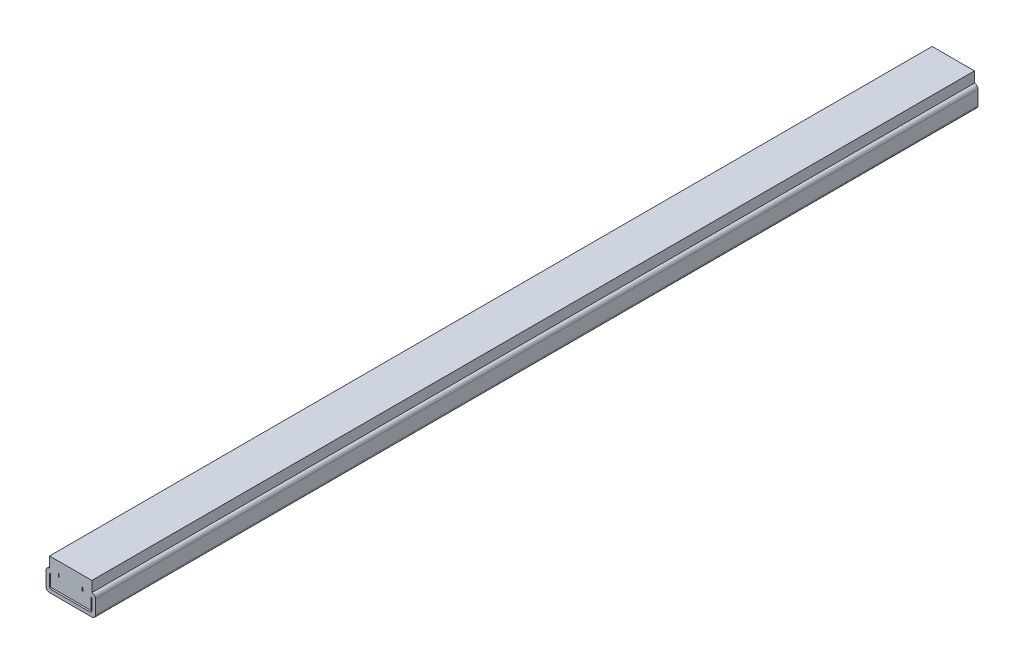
ISO-10303-21;
HEADER;
FILE_DESCRIPTION(('STEP AP214'),'2;1');
FILE_NAME('part.step','',(''),(''),'','','');
FILE_SCHEMA(('AUTOMOTIVE_DESIGN { 1 0 10303 214 1 1 1 1 }'));
ENDSEC;
DATA;
#1=APPLICATION_CONTEXT('core data for automotive mechanical design processes');
#2=APPLICATION_PROTOCOL_DEFINITION('international standard','automotive_design',2000,#1);
#3=PRODUCT_CONTEXT('',#1,'mechanical');
#4=PRODUCT('Part','Part','',(#3));
#5=PRODUCT_RELATED_PRODUCT_CATEGORY('part','',(#4));
#6=PRODUCT_DEFINITION_FORMATION('','',#4);
#7=PRODUCT_DEFINITION_CONTEXT('part definition',#1,'design');
#8=PRODUCT_DEFINITION('design','',#6,#7);
#9=PRODUCT_DEFINITION_SHAPE('','',#8);
#10=(LENGTH_UNIT() NAMED_UNIT(*) SI_UNIT(.MILLI.,.METRE.));
#11=(NAMED_UNIT(*) PLANE_ANGLE_UNIT() SI_UNIT($,.RADIAN.));
#12=(NAMED_UNIT(*) SI_UNIT($,.STERADIAN.) SOLID_ANGLE_UNIT());
#13=UNCERTAINTY_MEASURE_WITH_UNIT(LENGTH_MEASURE(1.E-05),#10,'distance_accuracy_value','');
#14=(GEOMETRIC_REPRESENTATION_CONTEXT(3) GLOBAL_UNCERTAINTY_ASSIGNED_CONTEXT((#13)) GLOBAL_UNIT_ASSIGNED_CONTEXT((#10,
#11,#12)) REPRESENTATION_CONTEXT('',''));
#15=CARTESIAN_POINT('',(0.,0.,0.));
#16=DIRECTION('',(0.,0.,1.));
#17=DIRECTION('',(1.,0.,0.));
#18=AXIS2_PLACEMENT_3D('',#15,#16,#17);
#19=CARTESIAN_POINT('',(12.,18.,0.));
#20=DIRECTION('',(0.,1.,0.));
#21=DIRECTION('',(0.,0.,1.));
#22=AXIS2_PLACEMENT_3D('',#19,#20,#21);
#23=PLANE('',#22);
#24=DIRECTION('',(0.,0.,1.));
#25=VECTOR('',#24,1.);
#26=CARTESIAN_POINT('',(12.,18.,0.));
#27=LINE('',#26,#25);
#28=CARTESIAN_POINT('',(12.,18.,0.));
#29=VERTEX_POINT('',#28);
#30=CARTESIAN_POINT('',(12.,18.,500.));
#31=VERTEX_POINT('',#30);
#32=EDGE_CURVE('E9',#29,#31,#27,.T.);
#33=ORIENTED_EDGE('',*,*,#32,.F.);
#34=DIRECTION('',(-1.,0.,0.));
#35=VECTOR('',#34,1.);
#36=CARTESIAN_POINT('',(12.,18.,0.));
#37=LINE('',#36,#35);
#38=CARTESIAN_POINT('',(-12.,18.,0.));
#39=VERTEX_POINT('',#38);
#40=EDGE_CURVE('E375',#29,#39,#37,.T.);
#41=ORIENTED_EDGE('',*,*,#40,.T.);
#42=DIRECTION('',(0.,0.,1.));
#43=VECTOR('',#42,1.);
#44=CARTESIAN_POINT('',(-12.,18.,0.));
#45=LINE('',#44,#43);
#46=CARTESIAN_POINT('',(-12.,18.,500.));
#47=VERTEX_POINT('',#46);
#48=EDGE_CURVE('E405',#39,#47,#45,.T.);
#49=ORIENTED_EDGE('',*,*,#48,.T.);
#50=DIRECTION('',(-1.,0.,0.));
#51=VECTOR('',#50,1.);
#52=CARTESIAN_POINT('',(12.,18.,500.));
#53=LINE('',#52,#51);
#54=EDGE_CURVE('E345',#31,#47,#53,.T.);
#55=ORIENTED_EDGE('',*,*,#54,.F.);
#56=EDGE_LOOP('',(#33,#41,#49,#55));
#57=FACE_BOUND('',#56,.T.);
#58=ADVANCED_FACE('F14',(#57),#23,.T.);
#59=CARTESIAN_POINT('',(12.,18.,0.));
#60=DIRECTION('',(-1.,0.,0.));
#61=DIRECTION('',(0.,0.,1.));
#62=AXIS2_PLACEMENT_3D('',#59,#60,#61);
#63=PLANE('',#62);
#64=DIRECTION('',(0.,0.,1.));
#65=VECTOR('',#64,1.);
#66=CARTESIAN_POINT('',(12.,12.,0.));
#67=LINE('',#66,#65);
#68=CARTESIAN_POINT('',(12.,12.,0.));
#69=VERTEX_POINT('',#68);
#70=CARTESIAN_POINT('',(12.,12.,500.));
#71=VERTEX_POINT('',#70);
#72=EDGE_CURVE('E22',#69,#71,#67,.T.);
#73=ORIENTED_EDGE('',*,*,#72,.F.);
#74=DIRECTION('',(0.,-1.,0.));
#75=VECTOR('',#74,1.);
#76=CARTESIAN_POINT('',(12.,18.,0.));
#77=LINE('',#76,#75);
#78=EDGE_CURVE('E402',#29,#69,#77,.T.);
#79=ORIENTED_EDGE('',*,*,#78,.F.);
#80=ORIENTED_EDGE('',*,*,#32,.T.);
#81=DIRECTION('',(0.,-1.,0.));
#82=VECTOR('',#81,1.);
#83=CARTESIAN_POINT('',(12.,18.,500.));
#84=LINE('',#83,#82);
#85=EDGE_CURVE('E372',#31,#71,#84,.T.);
#86=ORIENTED_EDGE('',*,*,#85,.T.);
#87=EDGE_LOOP('',(#73,#79,#80,#86));
#88=FACE_BOUND('',#87,.T.);
#89=ADVANCED_FACE('F16',(#88),#63,.F.);
#90=CARTESIAN_POINT('',(12.,10.,0.));
#91=DIRECTION('',(0.,0.,1.));
#92=DIRECTION('',(1.,0.,0.));
#93=AXIS2_PLACEMENT_3D('',#90,#91,#92);
#94=CYLINDRICAL_SURFACE('',#93,2.);
#95=DIRECTION('',(0.,0.,1.));
#96=VECTOR('',#95,1.);
#97=CARTESIAN_POINT('',(14.,10.,0.));
#98=LINE('',#97,#96);
#99=CARTESIAN_POINT('',(14.,10.,0.));
#100=VERTEX_POINT('',#99);
#101=CARTESIAN_POINT('',(14.,10.,500.));
#102=VERTEX_POINT('',#101);
#103=EDGE_CURVE('E419',#100,#102,#98,.T.);
#104=ORIENTED_EDGE('',*,*,#103,.F.);
#105=CARTESIAN_POINT('',(12.,10.,0.));
#106=DIRECTION('',(0.,0.,1.));
#107=DIRECTION('',(1.,0.,0.));
#108=AXIS2_PLACEMENT_3D('',#105,#106,#107);
#109=CIRCLE('',#108,2.);
#110=EDGE_CURVE('E399',#100,#69,#109,.T.);
#111=ORIENTED_EDGE('',*,*,#110,.T.);
#112=ORIENTED_EDGE('',*,*,#72,.T.);
#113=CARTESIAN_POINT('',(12.,10.,500.));
#114=DIRECTION('',(0.,0.,1.));
#115=DIRECTION('',(1.,0.,0.));
#116=AXIS2_PLACEMENT_3D('',#113,#114,#115);
#117=CIRCLE('',#116,2.);
#118=EDGE_CURVE('E369',#102,#71,#117,.T.);
#119=ORIENTED_EDGE('',*,*,#118,.F.);
#120=EDGE_LOOP('',(#104,#111,#112,#119));
#121=FACE_BOUND('',#120,.T.);
#122=ADVANCED_FACE('F422',(#121),#94,.T.);
#123=CARTESIAN_POINT('',(14.,10.,0.));
#124=DIRECTION('',(-1.,0.,0.));
#125=DIRECTION('',(0.,0.,1.));
#126=AXIS2_PLACEMENT_3D('',#123,#124,#125);
#127=PLANE('',#126);
#128=DIRECTION('',(0.,0.,1.));
#129=VECTOR('',#128,1.);
#130=CARTESIAN_POINT('',(14.,2.,0.));
#131=LINE('',#130,#129);
#132=CARTESIAN_POINT('',(14.,2.,0.));
#133=VERTEX_POINT('',#132);
#134=CARTESIAN_POINT('',(14.,2.,500.));
#135=VERTEX_POINT('',#134);
#136=EDGE_CURVE('E417',#133,#135,#131,.T.);
#137=ORIENTED_EDGE('',*,*,#136,.F.);
#138=DIRECTION('',(0.,-1.,0.));
#139=VECTOR('',#138,1.);
#140=CARTESIAN_POINT('',(14.,10.,0.));
#141=LINE('',#140,#139);
#142=EDGE_CURVE('E396',#100,#133,#141,.T.);
#143=ORIENTED_EDGE('',*,*,#142,.F.);
#144=ORIENTED_EDGE('',*,*,#103,.T.);
#145=DIRECTION('',(0.,-1.,0.));
#146=VECTOR('',#145,1.);
#147=CARTESIAN_POINT('',(14.,10.,500.));
#148=LINE('',#147,#146);
#149=EDGE_CURVE('E366',#102,#135,#148,.T.);
#150=ORIENTED_EDGE('',*,*,#149,.T.);
#151=EDGE_LOOP('',(#137,#143,#144,#150));
#152=FACE_BOUND('',#151,.T.);
#153=ADVANCED_FACE('F457',(#152),#127,.F.);
#154=CARTESIAN_POINT('',(12.,2.,0.));
#155=DIRECTION('',(0.,0.,1.));
#156=DIRECTION('',(1.,0.,0.));
#157=AXIS2_PLACEMENT_3D('',#154,#155,#156);
#158=CYLINDRICAL_SURFACE('',#157,2.);
#159=DIRECTION('',(0.,0.,1.));
#160=VECTOR('',#159,1.);
#161=CARTESIAN_POINT('',(12.,0.,0.));
#162=LINE('',#161,#160);
#163=CARTESIAN_POINT('',(12.,0.,0.));
#164=VERTEX_POINT('',#163);
#165=CARTESIAN_POINT('',(12.,0.,500.));
#166=VERTEX_POINT('',#165);
#167=EDGE_CURVE('E415',#164,#166,#162,.T.);
#168=ORIENTED_EDGE('',*,*,#167,.F.);
#169=CARTESIAN_POINT('',(12.,2.,0.));
#170=DIRECTION('',(0.,0.,1.));
#171=DIRECTION('',(1.,0.,0.));
#172=AXIS2_PLACEMENT_3D('',#169,#170,#171);
#173=CIRCLE('',#172,2.);
#174=EDGE_CURVE('E393',#164,#133,#173,.T.);
#175=ORIENTED_EDGE('',*,*,#174,.T.);
#176=ORIENTED_EDGE('',*,*,#136,.T.);
#177=CARTESIAN_POINT('',(12.,2.,500.));
#178=DIRECTION('',(0.,0.,1.));
#179=DIRECTION('',(1.,0.,0.));
#180=AXIS2_PLACEMENT_3D('',#177,#178,#179);
#181=CIRCLE('',#180,2.);
#182=EDGE_CURVE('E363',#166,#135,#181,.T.);
#183=ORIENTED_EDGE('',*,*,#182,.F.);
#184=EDGE_LOOP('',(#168,#175,#176,#183));
#185=FACE_BOUND('',#184,.T.);
#186=ADVANCED_FACE('F455',(#185),#158,.T.);
#187=CARTESIAN_POINT('',(12.,0.,0.));
#188=DIRECTION('',(0.,1.,0.));
#189=DIRECTION('',(0.,0.,1.));
#190=AXIS2_PLACEMENT_3D('',#187,#188,#189);
#191=PLANE('',#190);
#192=DIRECTION('',(0.,0.,1.));
#193=VECTOR('',#192,1.);
#194=CARTESIAN_POINT('',(-12.,0.,0.));
#195=LINE('',#194,#193);
#196=CARTESIAN_POINT('',(-12.,0.,0.));
#197=VERTEX_POINT('',#196);
#198=CARTESIAN_POINT('',(-12.,0.,500.));
#199=VERTEX_POINT('',#198);
#200=EDGE_CURVE('E413',#197,#199,#195,.T.);
#201=ORIENTED_EDGE('',*,*,#200,.F.);
#202=DIRECTION('',(-1.,0.,0.));
#203=VECTOR('',#202,1.);
#204=CARTESIAN_POINT('',(12.,0.,0.));
#205=LINE('',#204,#203);
#206=EDGE_CURVE('E390',#164,#197,#205,.T.);
#207=ORIENTED_EDGE('',*,*,#206,.F.);
#208=ORIENTED_EDGE('',*,*,#167,.T.);
#209=DIRECTION('',(-1.,0.,0.));
#210=VECTOR('',#209,1.);
#211=CARTESIAN_POINT('',(12.,0.,500.));
#212=LINE('',#211,#210);
#213=EDGE_CURVE('E360',#166,#199,#212,.T.);
#214=ORIENTED_EDGE('',*,*,#213,.T.);
#215=EDGE_LOOP('',(#201,#207,#208,#214));
#216=FACE_BOUND('',#215,.T.);
#217=ADVANCED_FACE('F451',(#216),#191,.F.);
#218=CARTESIAN_POINT('',(-12.,2.,0.));
#219=DIRECTION('',(0.,0.,1.));
#220=DIRECTION('',(1.,0.,0.));
#221=AXIS2_PLACEMENT_3D('',#218,#219,#220);
#222=CYLINDRICAL_SURFACE('',#221,2.);
#223=DIRECTION('',(0.,0.,1.));
#224=VECTOR('',#223,1.);
#225=CARTESIAN_POINT('',(-14.,2.,0.));
#226=LINE('',#225,#224);
#227=CARTESIAN_POINT('',(-14.,2.,0.));
#228=VERTEX_POINT('',#227);
#229=CARTESIAN_POINT('',(-14.,2.,500.));
#230=VERTEX_POINT('',#229);
#231=EDGE_CURVE('E411',#228,#230,#226,.T.);
#232=ORIENTED_EDGE('',*,*,#231,.F.);
#233=CARTESIAN_POINT('',(-12.,2.,0.));
#234=DIRECTION('',(0.,0.,1.));
#235=DIRECTION('',(1.,0.,0.));
#236=AXIS2_PLACEMENT_3D('',#233,#234,#235);
#237=CIRCLE('',#236,2.);
#238=EDGE_CURVE('E387',#228,#197,#237,.T.);
#239=ORIENTED_EDGE('',*,*,#238,.T.);
#240=ORIENTED_EDGE('',*,*,#200,.T.);
#241=CARTESIAN_POINT('',(-12.,2.,500.));
#242=DIRECTION('',(0.,0.,1.));
#243=DIRECTION('',(1.,0.,0.));
#244=AXIS2_PLACEMENT_3D('',#241,#242,#243);
#245=CIRCLE('',#244,2.);
#246=EDGE_CURVE('E357',#230,#199,#245,.T.);
#247=ORIENTED_EDGE('',*,*,#246,.F.);
#248=EDGE_LOOP('',(#232,#239,#240,#247));
#249=FACE_BOUND('',#248,.T.);
#250=ADVANCED_FACE('F447',(#249),#222,.T.);
#251=CARTESIAN_POINT('',(-14.,10.,0.));
#252=DIRECTION('',(-1.,0.,0.));
#253=DIRECTION('',(0.,0.,1.));
#254=AXIS2_PLACEMENT_3D('',#251,#252,#253);
#255=PLANE('',#254);
#256=DIRECTION('',(0.,0.,1.));
#257=VECTOR('',#256,1.);
#258=CARTESIAN_POINT('',(-14.,10.,0.));
#259=LINE('',#258,#257);
#260=CARTESIAN_POINT('',(-14.,10.,0.));
#261=VERTEX_POINT('',#260);
#262=CARTESIAN_POINT('',(-14.,10.,500.));
#263=VERTEX_POINT('',#262);
#264=EDGE_CURVE('E409',#261,#263,#259,.T.);
#265=ORIENTED_EDGE('',*,*,#264,.F.);
#266=DIRECTION('',(0.,-1.,0.));
#267=VECTOR('',#266,1.);
#268=CARTESIAN_POINT('',(-14.,10.,0.));
#269=LINE('',#268,#267);
#270=EDGE_CURVE('E384',#261,#228,#269,.T.);
#271=ORIENTED_EDGE('',*,*,#270,.T.);
#272=ORIENTED_EDGE('',*,*,#231,.T.);
#273=DIRECTION('',(0.,-1.,0.));
#274=VECTOR('',#273,1.);
#275=CARTESIAN_POINT('',(-14.,10.,500.));
#276=LINE('',#275,#274);
#277=EDGE_CURVE('E354',#263,#230,#276,.T.);
#278=ORIENTED_EDGE('',*,*,#277,.F.);
#279=EDGE_LOOP('',(#265,#271,#272,#278));
#280=FACE_BOUND('',#279,.T.);
#281=ADVANCED_FACE('F444',(#280),#255,.T.);
#282=CARTESIAN_POINT('',(-12.,10.,0.));
#283=DIRECTION('',(0.,0.,1.));
#284=DIRECTION('',(1.,0.,0.));
#285=AXIS2_PLACEMENT_3D('',#282,#283,#284);
#286=CYLINDRICAL_SURFACE('',#285,2.);
#287=DIRECTION('',(0.,0.,1.));
#288=VECTOR('',#287,1.);
#289=CARTESIAN_POINT('',(-12.,12.,0.));
#290=LINE('',#289,#288);
#291=CARTESIAN_POINT('',(-12.,12.,0.));
#292=VERTEX_POINT('',#291);
#293=CARTESIAN_POINT('',(-12.,12.,500.));
#294=VERTEX_POINT('',#293);
#295=EDGE_CURVE('E407',#292,#294,#290,.T.);
#296=ORIENTED_EDGE('',*,*,#295,.F.);
#297=CARTESIAN_POINT('',(-12.,10.,0.));
#298=DIRECTION('',(0.,0.,1.));
#299=DIRECTION('',(1.,0.,0.));
#300=AXIS2_PLACEMENT_3D('',#297,#298,#299);
#301=CIRCLE('',#300,2.);
#302=EDGE_CURVE('E381',#292,#261,#301,.T.);
#303=ORIENTED_EDGE('',*,*,#302,.T.);
#304=ORIENTED_EDGE('',*,*,#264,.T.);
#305=CARTESIAN_POINT('',(-12.,10.,500.));
#306=DIRECTION('',(0.,0.,1.));
#307=DIRECTION('',(1.,0.,0.));
#308=AXIS2_PLACEMENT_3D('',#305,#306,#307);
#309=CIRCLE('',#308,2.);
#310=EDGE_CURVE('E351',#294,#263,#309,.T.);
#311=ORIENTED_EDGE('',*,*,#310,.F.);
#312=EDGE_LOOP('',(#296,#303,#304,#311));
#313=FACE_BOUND('',#312,.T.);
#314=ADVANCED_FACE('F439',(#313),#286,.T.);
#315=CARTESIAN_POINT('',(-12.,18.,0.));
#316=DIRECTION('',(-1.,0.,0.));
#317=DIRECTION('',(0.,0.,1.));
#318=AXIS2_PLACEMENT_3D('',#315,#316,#317);
#319=PLANE('',#318);
#320=DIRECTION('',(0.,-1.,0.));
#321=VECTOR('',#320,1.);
#322=CARTESIAN_POINT('',(-12.,18.,0.));
#323=LINE('',#322,#321);
#324=EDGE_CURVE('E378',#39,#292,#323,.T.);
#325=ORIENTED_EDGE('',*,*,#324,.T.);
#326=ORIENTED_EDGE('',*,*,#295,.T.);
#327=DIRECTION('',(0.,-1.,0.));
#328=VECTOR('',#327,1.);
#329=CARTESIAN_POINT('',(-12.,18.,500.));
#330=LINE('',#329,#328);
#331=EDGE_CURVE('E348',#47,#294,#330,.T.);
#332=ORIENTED_EDGE('',*,*,#331,.F.);
#333=ORIENTED_EDGE('',*,*,#48,.F.);
#334=EDGE_LOOP('',(#325,#326,#332,#333));
#335=FACE_BOUND('',#334,.T.);
#336=ADVANCED_FACE('F435',(#335),#319,.T.);
#337=CARTESIAN_POINT('',(-12.,10.,0.));
#338=DIRECTION('',(0.,0.,1.));
#339=DIRECTION('',(1.,0.,0.));
#340=AXIS2_PLACEMENT_3D('',#337,#338,#339);
#341=PLANE('',#340);
#342=DIRECTION('',(0.,-1.,0.));
#343=VECTOR('',#342,1.);
#344=CARTESIAN_POINT('',(7.,12.,0.));
#345=LINE('',#344,#343);
#346=CARTESIAN_POINT('',(7.,12.,0.));
#347=VERTEX_POINT('',#346);
#348=CARTESIAN_POINT('',(7.,10.,0.));
#349=VERTEX_POINT('',#348);
#350=EDGE_CURVE('E227',#347,#349,#345,.T.);
#351=ORIENTED_EDGE('',*,*,#350,.F.);
#352=DIRECTION('',(-1.,0.,0.));
#353=VECTOR('',#352,1.);
#354=CARTESIAN_POINT('',(7.,12.,0.));
#355=LINE('',#354,#353);
#356=CARTESIAN_POINT('',(6.5,12.,0.));
#357=VERTEX_POINT('',#356);
#358=EDGE_CURVE('E218',#347,#357,#355,.T.);
#359=ORIENTED_EDGE('',*,*,#358,.T.);
#360=DIRECTION('',(0.,-1.,0.));
#361=VECTOR('',#360,1.);
#362=CARTESIAN_POINT('',(6.5,12.,0.));
#363=LINE('',#362,#361);
#364=CARTESIAN_POINT('',(6.5,10.,0.));
#365=VERTEX_POINT('',#364);
#366=EDGE_CURVE('E224',#357,#365,#363,.T.);
#367=ORIENTED_EDGE('',*,*,#366,.T.);
#368=DIRECTION('',(-1.,0.,0.));
#369=VECTOR('',#368,1.);
#370=CARTESIAN_POINT('',(7.,10.,0.));
#371=LINE('',#370,#369);
#372=EDGE_CURVE('E29',#349,#365,#371,.T.);
#373=ORIENTED_EDGE('',*,*,#372,.F.);
#374=EDGE_LOOP('',(#351,#359,#367,#373));
#375=FACE_BOUND('',#374,.T.);
#376=DIRECTION('',(0.,-1.,0.));
#377=VECTOR('',#376,1.);
#378=CARTESIAN_POINT('',(-6.5,12.,0.));
#379=LINE('',#378,#377);
#380=CARTESIAN_POINT('',(-6.5,12.,0.));
#381=VERTEX_POINT('',#380);
#382=CARTESIAN_POINT('',(-6.5,10.,0.));
#383=VERTEX_POINT('',#382);
#384=EDGE_CURVE('E253',#381,#383,#379,.T.);
#385=ORIENTED_EDGE('',*,*,#384,.F.);
#386=DIRECTION('',(-1.,0.,0.));
#387=VECTOR('',#386,1.);
#388=CARTESIAN_POINT('',(-6.5,12.,0.));
#389=LINE('',#388,#387);
#390=CARTESIAN_POINT('',(-7.,12.,0.));
#391=VERTEX_POINT('',#390);
#392=EDGE_CURVE('E245',#381,#391,#389,.T.);
#393=ORIENTED_EDGE('',*,*,#392,.T.);
#394=DIRECTION('',(0.,-1.,0.));
#395=VECTOR('',#394,1.);
#396=CARTESIAN_POINT('',(-7.,12.,0.));
#397=LINE('',#396,#395);
#398=CARTESIAN_POINT('',(-7.,10.,0.));
#399=VERTEX_POINT('',#398);
#400=EDGE_CURVE('E248',#391,#399,#397,.T.);
#401=ORIENTED_EDGE('',*,*,#400,.T.);
#402=DIRECTION('',(-1.,0.,0.));
#403=VECTOR('',#402,1.);
#404=CARTESIAN_POINT('',(-6.5,10.,0.));
#405=LINE('',#404,#403);
#406=EDGE_CURVE('E251',#383,#399,#405,.T.);
#407=ORIENTED_EDGE('',*,*,#406,.F.);
#408=EDGE_LOOP('',(#385,#393,#401,#407));
#409=FACE_BOUND('',#408,.T.);
#410=DIRECTION('',(0.,-1.,0.));
#411=VECTOR('',#410,1.);
#412=CARTESIAN_POINT('',(11.5,9.86602540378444,0.));
#413=LINE('',#412,#411);
#414=CARTESIAN_POINT('',(11.5,9.86602540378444,0.));
#415=VERTEX_POINT('',#414);
#416=CARTESIAN_POINT('',(11.5,3.,0.));
#417=VERTEX_POINT('',#416);
#418=EDGE_CURVE('E321',#415,#417,#413,.T.);
#419=ORIENTED_EDGE('',*,*,#418,.T.);
#420=DIRECTION('',(-1.,0.,0.));
#421=VECTOR('',#420,1.);
#422=CARTESIAN_POINT('',(11.5,3.,0.));
#423=LINE('',#422,#421);
#424=CARTESIAN_POINT('',(-11.5,3.,0.));
#425=VERTEX_POINT('',#424);
#426=EDGE_CURVE('E294',#417,#425,#423,.T.);
#427=ORIENTED_EDGE('',*,*,#426,.T.);
#428=DIRECTION('',(0.,-1.,0.));
#429=VECTOR('',#428,1.);
#430=CARTESIAN_POINT('',(-11.5,9.86602540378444,0.));
#431=LINE('',#430,#429);
#432=CARTESIAN_POINT('',(-11.5,9.86602540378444,0.));
#433=VERTEX_POINT('',#432);
#434=EDGE_CURVE('E297',#433,#425,#431,.T.);
#435=ORIENTED_EDGE('',*,*,#434,.F.);
#436=CARTESIAN_POINT('',(-11.,9.,0.));
#437=DIRECTION('',(0.,0.,1.));
#438=DIRECTION('',(1.,0.,0.));
#439=AXIS2_PLACEMENT_3D('',#436,#437,#438);
#440=CIRCLE('',#439,1.);
#441=CARTESIAN_POINT('',(-12.,9.,0.));
#442=VERTEX_POINT('',#441);
#443=EDGE_CURVE('E300',#433,#442,#440,.T.);
#444=ORIENTED_EDGE('',*,*,#443,.T.);
#445=DIRECTION('',(0.,-1.,0.));
#446=VECTOR('',#445,1.);
#447=CARTESIAN_POINT('',(-12.,9.,0.));
#448=LINE('',#447,#446);
#449=CARTESIAN_POINT('',(-12.,3.,0.));
#450=VERTEX_POINT('',#449);
#451=EDGE_CURVE('E303',#442,#450,#448,.T.);
#452=ORIENTED_EDGE('',*,*,#451,.T.);
#453=CARTESIAN_POINT('',(-11.,3.,0.));
#454=DIRECTION('',(0.,0.,1.));
#455=DIRECTION('',(1.,0.,0.));
#456=AXIS2_PLACEMENT_3D('',#453,#454,#455);
#457=CIRCLE('',#456,1.);
#458=CARTESIAN_POINT('',(-11.,2.,0.));
#459=VERTEX_POINT('',#458);
#460=EDGE_CURVE('E306',#450,#459,#457,.T.);
#461=ORIENTED_EDGE('',*,*,#460,.T.);
#462=DIRECTION('',(-1.,0.,0.));
#463=VECTOR('',#462,1.);
#464=CARTESIAN_POINT('',(11.,2.,0.));
#465=LINE('',#464,#463);
#466=CARTESIAN_POINT('',(11.,2.,0.));
#467=VERTEX_POINT('',#466);
#468=EDGE_CURVE('E309',#467,#459,#465,.T.);
#469=ORIENTED_EDGE('',*,*,#468,.F.);
#470=CARTESIAN_POINT('',(11.,3.,0.));
#471=DIRECTION('',(0.,0.,1.));
#472=DIRECTION('',(1.,0.,0.));
#473=AXIS2_PLACEMENT_3D('',#470,#471,#472);
#474=CIRCLE('',#473,1.);
#475=CARTESIAN_POINT('',(12.,3.,0.));
#476=VERTEX_POINT('',#475);
#477=EDGE_CURVE('E312',#467,#476,#474,.T.);
#478=ORIENTED_EDGE('',*,*,#477,.T.);
#479=DIRECTION('',(0.,-1.,0.));
#480=VECTOR('',#479,1.);
#481=CARTESIAN_POINT('',(12.,9.,0.));
#482=LINE('',#481,#480);
#483=CARTESIAN_POINT('',(12.,9.,0.));
#484=VERTEX_POINT('',#483);
#485=EDGE_CURVE('E315',#484,#476,#482,.T.);
#486=ORIENTED_EDGE('',*,*,#485,.F.);
#487=CARTESIAN_POINT('',(11.,9.,0.));
#488=DIRECTION('',(0.,0.,1.));
#489=DIRECTION('',(1.,0.,0.));
#490=AXIS2_PLACEMENT_3D('',#487,#488,#489);
#491=CIRCLE('',#490,1.);
#492=EDGE_CURVE('E318',#484,#415,#491,.T.);
#493=ORIENTED_EDGE('',*,*,#492,.T.);
#494=EDGE_LOOP('',(#419,#427,#435,#444,#452,#461,#469,#478,#486,#493));
#495=FACE_BOUND('',#494,.T.);
#496=ORIENTED_EDGE('',*,*,#40,.F.);
#497=ORIENTED_EDGE('',*,*,#78,.T.);
#498=ORIENTED_EDGE('',*,*,#110,.F.);
#499=ORIENTED_EDGE('',*,*,#142,.T.);
#500=ORIENTED_EDGE('',*,*,#174,.F.);
#501=ORIENTED_EDGE('',*,*,#206,.T.);
#502=ORIENTED_EDGE('',*,*,#238,.F.);
#503=ORIENTED_EDGE('',*,*,#270,.F.);
#504=ORIENTED_EDGE('',*,*,#302,.F.);
#505=ORIENTED_EDGE('',*,*,#324,.F.);
#506=EDGE_LOOP('',(#496,#497,#498,#499,#500,#501,#502,#503,#504,#505));
#507=FACE_BOUND('',#506,.T.);
#508=ADVANCED_FACE('F460',(#375,#409,#495,#507),#341,.F.);
#509=CARTESIAN_POINT('',(-12.,10.,500.));
#510=DIRECTION('',(0.,0.,1.));
#511=DIRECTION('',(1.,0.,0.));
#512=AXIS2_PLACEMENT_3D('',#509,#510,#511);
#513=PLANE('',#512);
#514=DIRECTION('',(-1.,0.,0.));
#515=VECTOR('',#514,1.);
#516=CARTESIAN_POINT('',(7.,12.,500.));
#517=LINE('',#516,#515);
#518=CARTESIAN_POINT('',(7.,12.,500.));
#519=VERTEX_POINT('',#518);
#520=CARTESIAN_POINT('',(6.5,12.,500.));
#521=VERTEX_POINT('',#520);
#522=EDGE_CURVE('E37',#519,#521,#517,.T.);
#523=ORIENTED_EDGE('',*,*,#522,.F.);
#524=DIRECTION('',(0.,-1.,0.));
#525=VECTOR('',#524,1.);
#526=CARTESIAN_POINT('',(7.,12.,500.));
#527=LINE('',#526,#525);
#528=CARTESIAN_POINT('',(7.,10.,500.));
#529=VERTEX_POINT('',#528);
#530=EDGE_CURVE('E216',#519,#529,#527,.T.);
#531=ORIENTED_EDGE('',*,*,#530,.T.);
#532=DIRECTION('',(-1.,0.,0.));
#533=VECTOR('',#532,1.);
#534=CARTESIAN_POINT('',(7.,10.,500.));
#535=LINE('',#534,#533);
#536=CARTESIAN_POINT('',(6.5,10.,500.));
#537=VERTEX_POINT('',#536);
#538=EDGE_CURVE('E200',#529,#537,#535,.T.);
#539=ORIENTED_EDGE('',*,*,#538,.T.);
#540=DIRECTION('',(0.,-1.,0.));
#541=VECTOR('',#540,1.);
#542=CARTESIAN_POINT('',(6.5,12.,500.));
#543=LINE('',#542,#541);
#544=EDGE_CURVE('E209',#521,#537,#543,.T.);
#545=ORIENTED_EDGE('',*,*,#544,.F.);
#546=EDGE_LOOP('',(#523,#531,#539,#545));
#547=FACE_BOUND('',#546,.T.);
#548=DIRECTION('',(-1.,0.,0.));
#549=VECTOR('',#548,1.);
#550=CARTESIAN_POINT('',(-6.5,12.,500.));
#551=LINE('',#550,#549);
#552=CARTESIAN_POINT('',(-6.5,12.,500.));
#553=VERTEX_POINT('',#552);
#554=CARTESIAN_POINT('',(-7.,12.,500.));
#555=VERTEX_POINT('',#554);
#556=EDGE_CURVE('E234',#553,#555,#551,.T.);
#557=ORIENTED_EDGE('',*,*,#556,.F.);
#558=DIRECTION('',(0.,-1.,0.));
#559=VECTOR('',#558,1.);
#560=CARTESIAN_POINT('',(-6.5,12.,500.));
#561=LINE('',#560,#559);
#562=CARTESIAN_POINT('',(-6.5,10.,500.));
#563=VERTEX_POINT('',#562);
#564=EDGE_CURVE('E242',#553,#563,#561,.T.);
#565=ORIENTED_EDGE('',*,*,#564,.T.);
#566=DIRECTION('',(-1.,0.,0.));
#567=VECTOR('',#566,1.);
#568=CARTESIAN_POINT('',(-6.5,10.,500.));
#569=LINE('',#568,#567);
#570=CARTESIAN_POINT('',(-7.,10.,500.));
#571=VERTEX_POINT('',#570);
#572=EDGE_CURVE('E239',#563,#571,#569,.T.);
#573=ORIENTED_EDGE('',*,*,#572,.T.);
#574=DIRECTION('',(0.,-1.,0.));
#575=VECTOR('',#574,1.);
#576=CARTESIAN_POINT('',(-7.,12.,500.));
#577=LINE('',#576,#575);
#578=EDGE_CURVE('E236',#555,#571,#577,.T.);
#579=ORIENTED_EDGE('',*,*,#578,.F.);
#580=EDGE_LOOP('',(#557,#565,#573,#579));
#581=FACE_BOUND('',#580,.T.);
#582=DIRECTION('',(-1.,0.,0.));
#583=VECTOR('',#582,1.);
#584=CARTESIAN_POINT('',(11.5,3.,500.));
#585=LINE('',#584,#583);
#586=CARTESIAN_POINT('',(11.5,3.,500.));
#587=VERTEX_POINT('',#586);
#588=CARTESIAN_POINT('',(-11.5,3.,500.));
#589=VERTEX_POINT('',#588);
#590=EDGE_CURVE('E265',#587,#589,#585,.T.);
#591=ORIENTED_EDGE('',*,*,#590,.F.);
#592=DIRECTION('',(0.,-1.,0.));
#593=VECTOR('',#592,1.);
#594=CARTESIAN_POINT('',(11.5,9.86602540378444,500.));
#595=LINE('',#594,#593);
#596=CARTESIAN_POINT('',(11.5,9.86602540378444,500.));
#597=VERTEX_POINT('',#596);
#598=EDGE_CURVE('E291',#597,#587,#595,.T.);
#599=ORIENTED_EDGE('',*,*,#598,.F.);
#600=CARTESIAN_POINT('',(11.,9.,500.));
#601=DIRECTION('',(0.,0.,1.));
#602=DIRECTION('',(1.,0.,0.));
#603=AXIS2_PLACEMENT_3D('',#600,#601,#602);
#604=CIRCLE('',#603,1.);
#605=CARTESIAN_POINT('',(12.,9.,500.));
#606=VERTEX_POINT('',#605);
#607=EDGE_CURVE('E288',#606,#597,#604,.T.);
#608=ORIENTED_EDGE('',*,*,#607,.F.);
#609=DIRECTION('',(0.,-1.,0.));
#610=VECTOR('',#609,1.);
#611=CARTESIAN_POINT('',(12.,9.,500.));
#612=LINE('',#611,#610);
#613=CARTESIAN_POINT('',(12.,3.,500.));
#614=VERTEX_POINT('',#613);
#615=EDGE_CURVE('E285',#606,#614,#612,.T.);
#616=ORIENTED_EDGE('',*,*,#615,.T.);
#617=CARTESIAN_POINT('',(11.,3.,500.));
#618=DIRECTION('',(0.,0.,1.));
#619=DIRECTION('',(1.,0.,0.));
#620=AXIS2_PLACEMENT_3D('',#617,#618,#619);
#621=CIRCLE('',#620,1.);
#622=CARTESIAN_POINT('',(11.,2.,500.));
#623=VERTEX_POINT('',#622);
#624=EDGE_CURVE('E282',#623,#614,#621,.T.);
#625=ORIENTED_EDGE('',*,*,#624,.F.);
#626=DIRECTION('',(-1.,0.,0.));
#627=VECTOR('',#626,1.);
#628=CARTESIAN_POINT('',(11.,2.,500.));
#629=LINE('',#628,#627);
#630=CARTESIAN_POINT('',(-11.,2.,500.));
#631=VERTEX_POINT('',#630);
#632=EDGE_CURVE('E279',#623,#631,#629,.T.);
#633=ORIENTED_EDGE('',*,*,#632,.T.);
#634=CARTESIAN_POINT('',(-11.,3.,500.));
#635=DIRECTION('',(0.,0.,1.));
#636=DIRECTION('',(1.,0.,0.));
#637=AXIS2_PLACEMENT_3D('',#634,#635,#636);
#638=CIRCLE('',#637,1.);
#639=CARTESIAN_POINT('',(-12.,3.,500.));
#640=VERTEX_POINT('',#639);
#641=EDGE_CURVE('E276',#640,#631,#638,.T.);
#642=ORIENTED_EDGE('',*,*,#641,.F.);
#643=DIRECTION('',(0.,-1.,0.));
#644=VECTOR('',#643,1.);
#645=CARTESIAN_POINT('',(-12.,9.,500.));
#646=LINE('',#645,#644);
#647=CARTESIAN_POINT('',(-12.,9.,500.));
#648=VERTEX_POINT('',#647);
#649=EDGE_CURVE('E273',#648,#640,#646,.T.);
#650=ORIENTED_EDGE('',*,*,#649,.F.);
#651=CARTESIAN_POINT('',(-11.,9.,500.));
#652=DIRECTION('',(0.,0.,1.));
#653=DIRECTION('',(1.,0.,0.));
#654=AXIS2_PLACEMENT_3D('',#651,#652,#653);
#655=CIRCLE('',#654,1.);
#656=CARTESIAN_POINT('',(-11.5,9.86602540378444,500.));
#657=VERTEX_POINT('',#656);
#658=EDGE_CURVE('E270',#657,#648,#655,.T.);
#659=ORIENTED_EDGE('',*,*,#658,.F.);
#660=DIRECTION('',(0.,-1.,0.));
#661=VECTOR('',#660,1.);
#662=CARTESIAN_POINT('',(-11.5,9.86602540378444,500.));
#663=LINE('',#662,#661);
#664=EDGE_CURVE('E267',#657,#589,#663,.T.);
#665=ORIENTED_EDGE('',*,*,#664,.T.);
#666=EDGE_LOOP('',(#591,#599,#608,#616,#625,#633,#642,#650,#659,#665));
#667=FACE_BOUND('',#666,.T.);
#668=ORIENTED_EDGE('',*,*,#54,.T.);
#669=ORIENTED_EDGE('',*,*,#331,.T.);
#670=ORIENTED_EDGE('',*,*,#310,.T.);
#671=ORIENTED_EDGE('',*,*,#277,.T.);
#672=ORIENTED_EDGE('',*,*,#246,.T.);
#673=ORIENTED_EDGE('',*,*,#213,.F.);
#674=ORIENTED_EDGE('',*,*,#182,.T.);
#675=ORIENTED_EDGE('',*,*,#149,.F.);
#676=ORIENTED_EDGE('',*,*,#118,.T.);
#677=ORIENTED_EDGE('',*,*,#85,.F.);
#678=EDGE_LOOP('',(#668,#669,#670,#671,#672,#673,#674,#675,#676,#677));
#679=FACE_BOUND('',#678,.T.);
#680=ADVANCED_FACE('F213',(#547,#581,#667,#679),#513,.T.);
#681=CARTESIAN_POINT('',(11.5,3.,0.));
#682=DIRECTION('',(0.,1.,0.));
#683=DIRECTION('',(0.,0.,1.));
#684=AXIS2_PLACEMENT_3D('',#681,#682,#683);
#685=PLANE('',#684);
#686=DIRECTION('',(0.,0.,1.));
#687=VECTOR('',#686,1.);
#688=CARTESIAN_POINT('',(11.5,3.,0.));
#689=LINE('',#688,#687);
#690=EDGE_CURVE('E343',#417,#587,#689,.T.);
#691=ORIENTED_EDGE('',*,*,#690,.T.);
#692=ORIENTED_EDGE('',*,*,#590,.T.);
#693=DIRECTION('',(0.,0.,1.));
#694=VECTOR('',#693,1.);
#695=CARTESIAN_POINT('',(-11.5,3.,0.));
#696=LINE('',#695,#694);
#697=EDGE_CURVE('E324',#425,#589,#696,.T.);
#698=ORIENTED_EDGE('',*,*,#697,.F.);
#699=ORIENTED_EDGE('',*,*,#426,.F.);
#700=EDGE_LOOP('',(#691,#692,#698,#699));
#701=FACE_BOUND('',#700,.T.);
#702=ADVANCED_FACE('F470',(#701),#685,.F.);
#703=CARTESIAN_POINT('',(11.5,9.86602540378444,0.));
#704=DIRECTION('',(-1.,0.,0.));
#705=DIRECTION('',(0.,0.,1.));
#706=AXIS2_PLACEMENT_3D('',#703,#704,#705);
#707=PLANE('',#706);
#708=DIRECTION('',(0.,0.,1.));
#709=VECTOR('',#708,1.);
#710=CARTESIAN_POINT('',(11.5,9.86602540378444,0.));
#711=LINE('',#710,#709);
#712=EDGE_CURVE('E341',#415,#597,#711,.T.);
#713=ORIENTED_EDGE('',*,*,#712,.T.);
#714=ORIENTED_EDGE('',*,*,#598,.T.);
#715=ORIENTED_EDGE('',*,*,#690,.F.);
#716=ORIENTED_EDGE('',*,*,#418,.F.);
#717=EDGE_LOOP('',(#713,#714,#715,#716));
#718=FACE_BOUND('',#717,.T.);
#719=ADVANCED_FACE('F560',(#718),#707,.F.);
#720=CARTESIAN_POINT('',(11.,9.,0.));
#721=DIRECTION('',(0.,0.,1.));
#722=DIRECTION('',(1.,0.,0.));
#723=AXIS2_PLACEMENT_3D('',#720,#721,#722);
#724=CYLINDRICAL_SURFACE('',#723,1.);
#725=DIRECTION('',(0.,0.,1.));
#726=VECTOR('',#725,1.);
#727=CARTESIAN_POINT('',(12.,9.,0.));
#728=LINE('',#727,#726);
#729=EDGE_CURVE('E339',#484,#606,#728,.T.);
#730=ORIENTED_EDGE('',*,*,#729,.T.);
#731=ORIENTED_EDGE('',*,*,#607,.T.);
#732=ORIENTED_EDGE('',*,*,#712,.F.);
#733=ORIENTED_EDGE('',*,*,#492,.F.);
#734=EDGE_LOOP('',(#730,#731,#732,#733));
#735=FACE_BOUND('',#734,.T.);
#736=ADVANCED_FACE('F568',(#735),#724,.F.);
#737=CARTESIAN_POINT('',(12.,9.,0.));
#738=DIRECTION('',(-1.,0.,0.));
#739=DIRECTION('',(0.,0.,1.));
#740=AXIS2_PLACEMENT_3D('',#737,#738,#739);
#741=PLANE('',#740);
#742=DIRECTION('',(0.,0.,1.));
#743=VECTOR('',#742,1.);
#744=CARTESIAN_POINT('',(12.,3.,0.));
#745=LINE('',#744,#743);
#746=EDGE_CURVE('E337',#476,#614,#745,.T.);
#747=ORIENTED_EDGE('',*,*,#746,.T.);
#748=ORIENTED_EDGE('',*,*,#615,.F.);
#749=ORIENTED_EDGE('',*,*,#729,.F.);
#750=ORIENTED_EDGE('',*,*,#485,.T.);
#751=EDGE_LOOP('',(#747,#748,#749,#750));
#752=FACE_BOUND('',#751,.T.);
#753=ADVANCED_FACE('F577',(#752),#741,.T.);
#754=CARTESIAN_POINT('',(11.,3.,0.));
#755=DIRECTION('',(0.,0.,1.));
#756=DIRECTION('',(1.,0.,0.));
#757=AXIS2_PLACEMENT_3D('',#754,#755,#756);
#758=CYLINDRICAL_SURFACE('',#757,1.);
#759=DIRECTION('',(0.,0.,1.));
#760=VECTOR('',#759,1.);
#761=CARTESIAN_POINT('',(11.,2.,0.));
#762=LINE('',#761,#760);
#763=EDGE_CURVE('E335',#467,#623,#762,.T.);
#764=ORIENTED_EDGE('',*,*,#763,.T.);
#765=ORIENTED_EDGE('',*,*,#624,.T.);
#766=ORIENTED_EDGE('',*,*,#746,.F.);
#767=ORIENTED_EDGE('',*,*,#477,.F.);
#768=EDGE_LOOP('',(#764,#765,#766,#767));
#769=FACE_BOUND('',#768,.T.);
#770=ADVANCED_FACE('F586',(#769),#758,.F.);
#771=CARTESIAN_POINT('',(11.,2.,0.));
#772=DIRECTION('',(0.,1.,0.));
#773=DIRECTION('',(0.,0.,1.));
#774=AXIS2_PLACEMENT_3D('',#771,#772,#773);
#775=PLANE('',#774);
#776=DIRECTION('',(0.,0.,1.));
#777=VECTOR('',#776,1.);
#778=CARTESIAN_POINT('',(-11.,2.,0.));
#779=LINE('',#778,#777);
#780=EDGE_CURVE('E333',#459,#631,#779,.T.);
#781=ORIENTED_EDGE('',*,*,#780,.T.);
#782=ORIENTED_EDGE('',*,*,#632,.F.);
#783=ORIENTED_EDGE('',*,*,#763,.F.);
#784=ORIENTED_EDGE('',*,*,#468,.T.);
#785=EDGE_LOOP('',(#781,#782,#783,#784));
#786=FACE_BOUND('',#785,.T.);
#787=ADVANCED_FACE('F595',(#786),#775,.T.);
#788=CARTESIAN_POINT('',(-11.,3.,0.));
#789=DIRECTION('',(0.,0.,1.));
#790=DIRECTION('',(1.,0.,0.));
#791=AXIS2_PLACEMENT_3D('',#788,#789,#790);
#792=CYLINDRICAL_SURFACE('',#791,1.);
#793=DIRECTION('',(0.,0.,1.));
#794=VECTOR('',#793,1.);
#795=CARTESIAN_POINT('',(-12.,3.,0.));
#796=LINE('',#795,#794);
#797=EDGE_CURVE('E331',#450,#640,#796,.T.);
#798=ORIENTED_EDGE('',*,*,#797,.T.);
#799=ORIENTED_EDGE('',*,*,#641,.T.);
#800=ORIENTED_EDGE('',*,*,#780,.F.);
#801=ORIENTED_EDGE('',*,*,#460,.F.);
#802=EDGE_LOOP('',(#798,#799,#800,#801));
#803=FACE_BOUND('',#802,.T.);
#804=ADVANCED_FACE('F604',(#803),#792,.F.);
#805=CARTESIAN_POINT('',(-12.,9.,0.));
#806=DIRECTION('',(-1.,0.,0.));
#807=DIRECTION('',(0.,0.,1.));
#808=AXIS2_PLACEMENT_3D('',#805,#806,#807);
#809=PLANE('',#808);
#810=DIRECTION('',(0.,0.,1.));
#811=VECTOR('',#810,1.);
#812=CARTESIAN_POINT('',(-12.,9.,0.));
#813=LINE('',#812,#811);
#814=EDGE_CURVE('E329',#442,#648,#813,.T.);
#815=ORIENTED_EDGE('',*,*,#814,.T.);
#816=ORIENTED_EDGE('',*,*,#649,.T.);
#817=ORIENTED_EDGE('',*,*,#797,.F.);
#818=ORIENTED_EDGE('',*,*,#451,.F.);
#819=EDGE_LOOP('',(#815,#816,#817,#818));
#820=FACE_BOUND('',#819,.T.);
#821=ADVANCED_FACE('F613',(#820),#809,.F.);
#822=CARTESIAN_POINT('',(-11.,9.,0.));
#823=DIRECTION('',(0.,0.,1.));
#824=DIRECTION('',(1.,0.,0.));
#825=AXIS2_PLACEMENT_3D('',#822,#823,#824);
#826=CYLINDRICAL_SURFACE('',#825,1.);
#827=DIRECTION('',(0.,0.,1.));
#828=VECTOR('',#827,1.);
#829=CARTESIAN_POINT('',(-11.5,9.86602540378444,0.));
#830=LINE('',#829,#828);
#831=EDGE_CURVE('E327',#433,#657,#830,.T.);
#832=ORIENTED_EDGE('',*,*,#831,.T.);
#833=ORIENTED_EDGE('',*,*,#658,.T.);
#834=ORIENTED_EDGE('',*,*,#814,.F.);
#835=ORIENTED_EDGE('',*,*,#443,.F.);
#836=EDGE_LOOP('',(#832,#833,#834,#835));
#837=FACE_BOUND('',#836,.T.);
#838=ADVANCED_FACE('F622',(#837),#826,.F.);
#839=CARTESIAN_POINT('',(-11.5,9.86602540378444,0.));
#840=DIRECTION('',(-1.,0.,0.));
#841=DIRECTION('',(0.,0.,1.));
#842=AXIS2_PLACEMENT_3D('',#839,#840,#841);
#843=PLANE('',#842);
#844=ORIENTED_EDGE('',*,*,#434,.T.);
#845=ORIENTED_EDGE('',*,*,#697,.T.);
#846=ORIENTED_EDGE('',*,*,#664,.F.);
#847=ORIENTED_EDGE('',*,*,#831,.F.);
#848=EDGE_LOOP('',(#844,#845,#846,#847));
#849=FACE_BOUND('',#848,.T.);
#850=ADVANCED_FACE('F631',(#849),#843,.T.);
#851=CARTESIAN_POINT('',(-6.5,12.,0.));
#852=DIRECTION('',(0.,1.,0.));
#853=DIRECTION('',(0.,0.,1.));
#854=AXIS2_PLACEMENT_3D('',#851,#852,#853);
#855=PLANE('',#854);
#856=DIRECTION('',(0.,0.,1.));
#857=VECTOR('',#856,1.);
#858=CARTESIAN_POINT('',(-6.5,12.,0.));
#859=LINE('',#858,#857);
#860=EDGE_CURVE('E263',#381,#553,#859,.T.);
#861=ORIENTED_EDGE('',*,*,#860,.T.);
#862=ORIENTED_EDGE('',*,*,#556,.T.);
#863=DIRECTION('',(0.,0.,1.));
#864=VECTOR('',#863,1.);
#865=CARTESIAN_POINT('',(-7.,12.,0.));
#866=LINE('',#865,#864);
#867=EDGE_CURVE('E256',#391,#555,#866,.T.);
#868=ORIENTED_EDGE('',*,*,#867,.F.);
#869=ORIENTED_EDGE('',*,*,#392,.F.);
#870=EDGE_LOOP('',(#861,#862,#868,#869));
#871=FACE_BOUND('',#870,.T.);
#872=ADVANCED_FACE('F640',(#871),#855,.F.);
#873=CARTESIAN_POINT('',(-6.5,12.,0.));
#874=DIRECTION('',(-1.,0.,0.));
#875=DIRECTION('',(0.,0.,1.));
#876=AXIS2_PLACEMENT_3D('',#873,#874,#875);
#877=PLANE('',#876);
#878=DIRECTION('',(0.,0.,1.));
#879=VECTOR('',#878,1.);
#880=CARTESIAN_POINT('',(-6.5,10.,0.));
#881=LINE('',#880,#879);
#882=EDGE_CURVE('E261',#383,#563,#881,.T.);
#883=ORIENTED_EDGE('',*,*,#882,.T.);
#884=ORIENTED_EDGE('',*,*,#564,.F.);
#885=ORIENTED_EDGE('',*,*,#860,.F.);
#886=ORIENTED_EDGE('',*,*,#384,.T.);
#887=EDGE_LOOP('',(#883,#884,#885,#886));
#888=FACE_BOUND('',#887,.T.);
#889=ADVANCED_FACE('F649',(#888),#877,.T.);
#890=CARTESIAN_POINT('',(-6.5,10.,0.));
#891=DIRECTION('',(0.,1.,0.));
#892=DIRECTION('',(0.,0.,1.));
#893=AXIS2_PLACEMENT_3D('',#890,#891,#892);
#894=PLANE('',#893);
#895=DIRECTION('',(0.,0.,1.));
#896=VECTOR('',#895,1.);
#897=CARTESIAN_POINT('',(-7.,10.,0.));
#898=LINE('',#897,#896);
#899=EDGE_CURVE('E259',#399,#571,#898,.T.);
#900=ORIENTED_EDGE('',*,*,#899,.T.);
#901=ORIENTED_EDGE('',*,*,#572,.F.);
#902=ORIENTED_EDGE('',*,*,#882,.F.);
#903=ORIENTED_EDGE('',*,*,#406,.T.);
#904=EDGE_LOOP('',(#900,#901,#902,#903));
#905=FACE_BOUND('',#904,.T.);
#906=ADVANCED_FACE('F658',(#905),#894,.T.);
#907=CARTESIAN_POINT('',(-7.,12.,0.));
#908=DIRECTION('',(-1.,0.,0.));
#909=DIRECTION('',(0.,0.,1.));
#910=AXIS2_PLACEMENT_3D('',#907,#908,#909);
#911=PLANE('',#910);
#912=ORIENTED_EDGE('',*,*,#400,.F.);
#913=ORIENTED_EDGE('',*,*,#867,.T.);
#914=ORIENTED_EDGE('',*,*,#578,.T.);
#915=ORIENTED_EDGE('',*,*,#899,.F.);
#916=EDGE_LOOP('',(#912,#913,#914,#915));
#917=FACE_BOUND('',#916,.T.);
#918=ADVANCED_FACE('F667',(#917),#911,.F.);
#919=CARTESIAN_POINT('',(7.,12.,0.));
#920=DIRECTION('',(0.,1.,0.));
#921=DIRECTION('',(0.,0.,1.));
#922=AXIS2_PLACEMENT_3D('',#919,#920,#921);
#923=PLANE('',#922);
#924=DIRECTION('',(0.,0.,1.));
#925=VECTOR('',#924,1.);
#926=CARTESIAN_POINT('',(7.,12.,0.));
#927=LINE('',#926,#925);
#928=EDGE_CURVE('E232',#347,#519,#927,.T.);
#929=ORIENTED_EDGE('',*,*,#928,.T.);
#930=ORIENTED_EDGE('',*,*,#522,.T.);
#931=DIRECTION('',(0.,0.,1.));
#932=VECTOR('',#931,1.);
#933=CARTESIAN_POINT('',(6.5,12.,0.));
#934=LINE('',#933,#932);
#935=EDGE_CURVE('E206',#357,#521,#934,.T.);
#936=ORIENTED_EDGE('',*,*,#935,.F.);
#937=ORIENTED_EDGE('',*,*,#358,.F.);
#938=EDGE_LOOP('',(#929,#930,#936,#937));
#939=FACE_BOUND('',#938,.T.);
#940=ADVANCED_FACE('F676',(#939),#923,.F.);
#941=CARTESIAN_POINT('',(7.,12.,0.));
#942=DIRECTION('',(-1.,0.,0.));
#943=DIRECTION('',(0.,0.,1.));
#944=AXIS2_PLACEMENT_3D('',#941,#942,#943);
#945=PLANE('',#944);
#946=DIRECTION('',(0.,0.,1.));
#947=VECTOR('',#946,1.);
#948=CARTESIAN_POINT('',(7.,10.,0.));
#949=LINE('',#948,#947);
#950=EDGE_CURVE('E205',#349,#529,#949,.T.);
#951=ORIENTED_EDGE('',*,*,#950,.T.);
#952=ORIENTED_EDGE('',*,*,#530,.F.);
#953=ORIENTED_EDGE('',*,*,#928,.F.);
#954=ORIENTED_EDGE('',*,*,#350,.T.);
#955=EDGE_LOOP('',(#951,#952,#953,#954));
#956=FACE_BOUND('',#955,.T.);
#957=ADVANCED_FACE('F685',(#956),#945,.T.);
#958=CARTESIAN_POINT('',(7.,10.,0.));
#959=DIRECTION('',(0.,1.,0.));
#960=DIRECTION('',(0.,0.,1.));
#961=AXIS2_PLACEMENT_3D('',#958,#959,#960);
#962=PLANE('',#961);
#963=DIRECTION('',(0.,0.,1.));
#964=VECTOR('',#963,1.);
#965=CARTESIAN_POINT('',(6.5,10.,0.));
#966=LINE('',#965,#964);
#967=EDGE_CURVE('E196',#365,#537,#966,.T.);
#968=ORIENTED_EDGE('',*,*,#967,.T.);
#969=ORIENTED_EDGE('',*,*,#538,.F.);
#970=ORIENTED_EDGE('',*,*,#950,.F.);
#971=ORIENTED_EDGE('',*,*,#372,.T.);
#972=EDGE_LOOP('',(#968,#969,#970,#971));
#973=FACE_BOUND('',#972,.T.);
#974=ADVANCED_FACE('F198',(#973),#962,.T.);
#975=CARTESIAN_POINT('',(6.5,12.,0.));
#976=DIRECTION('',(-1.,0.,0.));
#977=DIRECTION('',(0.,0.,1.));
#978=AXIS2_PLACEMENT_3D('',#975,#976,#977);
#979=PLANE('',#978);
#980=ORIENTED_EDGE('',*,*,#366,.F.);
#981=ORIENTED_EDGE('',*,*,#935,.T.);
#982=ORIENTED_EDGE('',*,*,#544,.T.);
#983=ORIENTED_EDGE('',*,*,#967,.F.);
#984=EDGE_LOOP('',(#980,#981,#982,#983));
#985=FACE_BOUND('',#984,.T.);
#986=ADVANCED_FACE('F210',(#985),#979,.F.);
#987=CLOSED_SHELL('',(#58,#89,#122,#153,#186,#217,#250,#281,#314,#336,#508,#680,#702,#719,#736,
#753,#770,#787,#804,#821,#838,#850,#872,#889,#906,#918,#940,#957,#974,#986));
#988=MANIFOLD_SOLID_BREP('B1',#987);
#989=ADVANCED_BREP_SHAPE_REPRESENTATION('',(#18,#988),#14);
#990=SHAPE_DEFINITION_REPRESENTATION(#9,#989);
ENDSEC;
END-ISO-10303-21;
